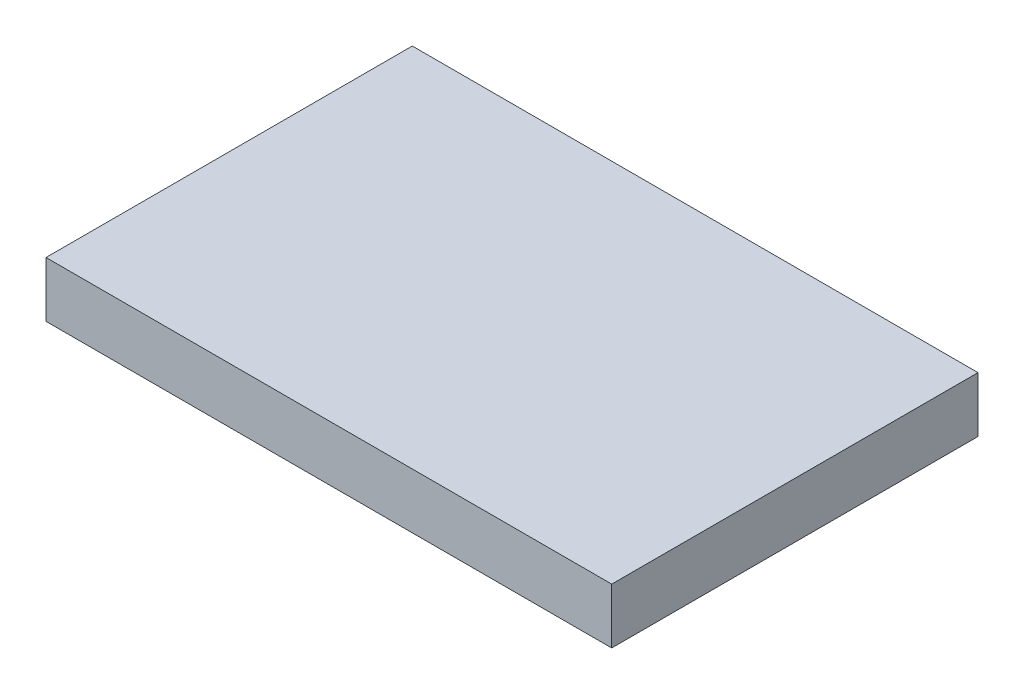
from build123d import *

# Parameters (mm, degrees)
SKETCH1_W      = 127.25936214
SKETCH1_H      = 82.398148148
EXTRUDE1_DEPTH = 12.446


with BuildPart() as part:
    # Sketch1 → Extrude1 (new body)
    with BuildSketch(Plane(origin=(0, 0, 0), x_dir=(1, 0, 0), z_dir=(0, 1, 0))):
        Rectangle(SKETCH1_W, SKETCH1_H)
    extrude(amount=EXTRUDE1_DEPTH)


solid = part.part
